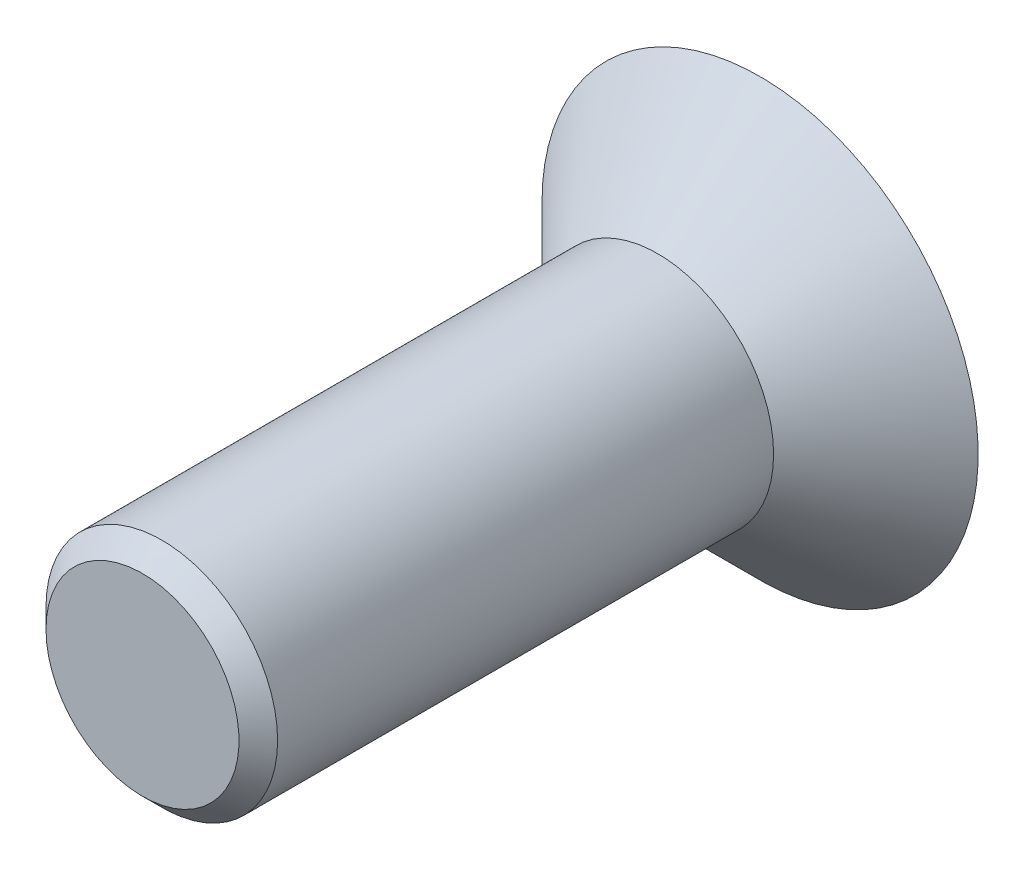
ISO-10303-21;
HEADER;
FILE_DESCRIPTION(('STEP AP214'),'2;1');
FILE_NAME('part.step','',(''),(''),'','','');
FILE_SCHEMA(('AUTOMOTIVE_DESIGN { 1 0 10303 214 1 1 1 1 }'));
ENDSEC;
DATA;
#1=APPLICATION_CONTEXT('core data for automotive mechanical design processes');
#2=APPLICATION_PROTOCOL_DEFINITION('international standard','automotive_design',2000,#1);
#3=PRODUCT_CONTEXT('',#1,'mechanical');
#4=PRODUCT('Part','Part','',(#3));
#5=PRODUCT_RELATED_PRODUCT_CATEGORY('part','',(#4));
#6=PRODUCT_DEFINITION_FORMATION('','',#4);
#7=PRODUCT_DEFINITION_CONTEXT('part definition',#1,'design');
#8=PRODUCT_DEFINITION('design','',#6,#7);
#9=PRODUCT_DEFINITION_SHAPE('','',#8);
#10=(LENGTH_UNIT() NAMED_UNIT(*) SI_UNIT(.MILLI.,.METRE.));
#11=(NAMED_UNIT(*) PLANE_ANGLE_UNIT() SI_UNIT($,.RADIAN.));
#12=(NAMED_UNIT(*) SI_UNIT($,.STERADIAN.) SOLID_ANGLE_UNIT());
#13=UNCERTAINTY_MEASURE_WITH_UNIT(LENGTH_MEASURE(1.E-05),#10,'distance_accuracy_value','');
#14=(GEOMETRIC_REPRESENTATION_CONTEXT(3) GLOBAL_UNCERTAINTY_ASSIGNED_CONTEXT((#13)) GLOBAL_UNIT_ASSIGNED_CONTEXT((#10,
#11,#12)) REPRESENTATION_CONTEXT('',''));
#15=CARTESIAN_POINT('',(0.,0.,0.));
#16=DIRECTION('',(0.,0.,1.));
#17=DIRECTION('',(1.,0.,0.));
#18=AXIS2_PLACEMENT_3D('',#15,#16,#17);
#19=CARTESIAN_POINT('',(0.,0.,2.65));
#20=DIRECTION('',(0.,0.,-1.));
#21=DIRECTION('',(-1.,0.,0.));
#22=AXIS2_PLACEMENT_3D('',#19,#20,#21);
#23=CONICAL_SURFACE('',#22,3.,0.785398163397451);
#24=CARTESIAN_POINT('',(0.,0.,0.));
#25=DIRECTION('',(0.,0.,-1.));
#26=DIRECTION('',(-1.,0.,0.));
#27=AXIS2_PLACEMENT_3D('',#24,#25,#26);
#28=CIRCLE('',#27,5.65000000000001);
#29=CARTESIAN_POINT('',(-5.65000000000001,0.,0.));
#30=VERTEX_POINT('',#29);
#31=EDGE_CURVE('E11',#30,#30,#28,.T.);
#32=ORIENTED_EDGE('',*,*,#31,.F.);
#33=EDGE_LOOP('',(#32));
#34=FACE_BOUND('',#33,.T.);
#35=CARTESIAN_POINT('',(0.,0.,2.65));
#36=DIRECTION('',(0.,0.,1.));
#37=DIRECTION('',(1.,0.,0.));
#38=AXIS2_PLACEMENT_3D('',#35,#36,#37);
#39=CIRCLE('',#38,3.);
#40=CARTESIAN_POINT('',(3.,0.,2.65));
#41=VERTEX_POINT('',#40);
#42=EDGE_CURVE('E146',#41,#41,#39,.T.);
#43=ORIENTED_EDGE('',*,*,#42,.F.);
#44=EDGE_LOOP('',(#43));
#45=FACE_BOUND('',#44,.T.);
#46=ADVANCED_FACE('F32',(#34,#45),#23,.T.);
#47=CARTESIAN_POINT('',(0.,0.,0.));
#48=DIRECTION('',(0.,0.,1.));
#49=DIRECTION('',(1.,0.,0.));
#50=AXIS2_PLACEMENT_3D('',#47,#48,#49);
#51=PLANE('',#50);
#52=DIRECTION('',(0.,-1.,0.));
#53=VECTOR('',#52,1.);
#54=CARTESIAN_POINT('',(2.,1.15470053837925,0.));
#55=LINE('',#54,#53);
#56=CARTESIAN_POINT('',(2.,1.15470053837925,0.));
#57=VERTEX_POINT('',#56);
#58=CARTESIAN_POINT('',(2.,-1.15470053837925,0.));
#59=VERTEX_POINT('',#58);
#60=EDGE_CURVE('E100',#57,#59,#55,.T.);
#61=ORIENTED_EDGE('',*,*,#60,.F.);
#62=DIRECTION('',(0.866025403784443,-0.499999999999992,0.));
#63=VECTOR('',#62,1.);
#64=CARTESIAN_POINT('',(2.,1.15470053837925,0.));
#65=LINE('',#64,#63);
#66=CARTESIAN_POINT('',(0.,2.30940107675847,0.));
#67=VERTEX_POINT('',#66);
#68=EDGE_CURVE('E47',#67,#57,#65,.T.);
#69=ORIENTED_EDGE('',*,*,#68,.F.);
#70=DIRECTION('',(0.866025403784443,0.499999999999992,0.));
#71=VECTOR('',#70,1.);
#72=CARTESIAN_POINT('',(-2.,1.15470053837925,0.));
#73=LINE('',#72,#71);
#74=CARTESIAN_POINT('',(-2.,1.15470053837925,0.));
#75=VERTEX_POINT('',#74);
#76=EDGE_CURVE('E115',#75,#67,#73,.T.);
#77=ORIENTED_EDGE('',*,*,#76,.F.);
#78=DIRECTION('',(0.,1.,0.));
#79=VECTOR('',#78,1.);
#80=CARTESIAN_POINT('',(-2.,1.15470053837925,0.));
#81=LINE('',#80,#79);
#82=CARTESIAN_POINT('',(-2.,-1.15470053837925,0.));
#83=VERTEX_POINT('',#82);
#84=EDGE_CURVE('E109',#83,#75,#81,.T.);
#85=ORIENTED_EDGE('',*,*,#84,.F.);
#86=DIRECTION('',(-0.866025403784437,0.500000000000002,0.));
#87=VECTOR('',#86,1.);
#88=CARTESIAN_POINT('',(-2.,-1.15470053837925,0.));
#89=LINE('',#88,#87);
#90=CARTESIAN_POINT('',(0.,-2.3094010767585,0.));
#91=VERTEX_POINT('',#90);
#92=EDGE_CURVE('E107',#91,#83,#89,.T.);
#93=ORIENTED_EDGE('',*,*,#92,.F.);
#94=DIRECTION('',(-0.866025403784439,-0.5,0.));
#95=VECTOR('',#94,1.);
#96=CARTESIAN_POINT('',(2.,-1.15470053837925,0.));
#97=LINE('',#96,#95);
#98=EDGE_CURVE('E89',#59,#91,#97,.T.);
#99=ORIENTED_EDGE('',*,*,#98,.F.);
#100=EDGE_LOOP('',(#61,#69,#77,#85,#93,#99));
#101=FACE_BOUND('',#100,.T.);
#102=ORIENTED_EDGE('',*,*,#31,.T.);
#103=EDGE_LOOP('',(#102));
#104=FACE_BOUND('',#103,.T.);
#105=ADVANCED_FACE('F34',(#101,#104),#51,.F.);
#106=CARTESIAN_POINT('',(2.,1.15470053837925,1.65625));
#107=DIRECTION('',(0.499999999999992,0.866025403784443,0.));
#108=DIRECTION('',(-0.866025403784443,0.499999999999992,0.));
#109=AXIS2_PLACEMENT_3D('',#106,#107,#108);
#110=PLANE('',#109);
#111=ORIENTED_EDGE('',*,*,#68,.T.);
#112=DIRECTION('',(0.,0.,-1.));
#113=VECTOR('',#112,1.);
#114=CARTESIAN_POINT('',(2.,1.15470053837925,1.65625));
#115=LINE('',#114,#113);
#116=CARTESIAN_POINT('',(2.,1.15470053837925,1.65625));
#117=VERTEX_POINT('',#116);
#118=EDGE_CURVE('E97',#117,#57,#115,.T.);
#119=ORIENTED_EDGE('',*,*,#118,.F.);
#120=DIRECTION('',(0.866025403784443,-0.499999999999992,0.));
#121=VECTOR('',#120,1.);
#122=CARTESIAN_POINT('',(2.,1.15470053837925,1.65625));
#123=LINE('',#122,#121);
#124=CARTESIAN_POINT('',(0.,2.30940107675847,1.65625));
#125=VERTEX_POINT('',#124);
#126=EDGE_CURVE('E117',#125,#117,#123,.T.);
#127=ORIENTED_EDGE('',*,*,#126,.F.);
#128=DIRECTION('',(0.,0.,-1.));
#129=VECTOR('',#128,1.);
#130=CARTESIAN_POINT('',(0.,2.30940107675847,1.65625));
#131=LINE('',#130,#129);
#132=EDGE_CURVE('E40',#125,#67,#131,.T.);
#133=ORIENTED_EDGE('',*,*,#132,.T.);
#134=EDGE_LOOP('',(#111,#119,#127,#133));
#135=FACE_BOUND('',#134,.T.);
#136=ADVANCED_FACE('F143',(#135),#110,.F.);
#137=CARTESIAN_POINT('',(-2.,1.15470053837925,1.65625));
#138=DIRECTION('',(-0.499999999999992,0.866025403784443,0.));
#139=DIRECTION('',(-0.866025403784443,-0.499999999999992,0.));
#140=AXIS2_PLACEMENT_3D('',#137,#138,#139);
#141=PLANE('',#140);
#142=ORIENTED_EDGE('',*,*,#76,.T.);
#143=ORIENTED_EDGE('',*,*,#132,.F.);
#144=DIRECTION('',(0.866025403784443,0.499999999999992,0.));
#145=VECTOR('',#144,1.);
#146=CARTESIAN_POINT('',(-2.,1.15470053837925,1.65625));
#147=LINE('',#146,#145);
#148=CARTESIAN_POINT('',(-2.,1.15470053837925,1.65625));
#149=VERTEX_POINT('',#148);
#150=EDGE_CURVE('E129',#149,#125,#147,.T.);
#151=ORIENTED_EDGE('',*,*,#150,.F.);
#152=DIRECTION('',(0.,0.,-1.));
#153=VECTOR('',#152,1.);
#154=CARTESIAN_POINT('',(-2.,1.15470053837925,1.65625));
#155=LINE('',#154,#153);
#156=EDGE_CURVE('E133',#149,#75,#155,.T.);
#157=ORIENTED_EDGE('',*,*,#156,.T.);
#158=EDGE_LOOP('',(#142,#143,#151,#157));
#159=FACE_BOUND('',#158,.T.);
#160=ADVANCED_FACE('F145',(#159),#141,.F.);
#161=CARTESIAN_POINT('',(-2.,1.15470053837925,1.65625));
#162=DIRECTION('',(-1.,0.,0.));
#163=DIRECTION('',(0.,0.,1.));
#164=AXIS2_PLACEMENT_3D('',#161,#162,#163);
#165=PLANE('',#164);
#166=ORIENTED_EDGE('',*,*,#84,.T.);
#167=ORIENTED_EDGE('',*,*,#156,.F.);
#168=DIRECTION('',(0.,1.,0.));
#169=VECTOR('',#168,1.);
#170=CARTESIAN_POINT('',(-2.,1.15470053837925,1.65625));
#171=LINE('',#170,#169);
#172=CARTESIAN_POINT('',(-2.,-1.15470053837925,1.65625));
#173=VERTEX_POINT('',#172);
#174=EDGE_CURVE('E126',#173,#149,#171,.T.);
#175=ORIENTED_EDGE('',*,*,#174,.F.);
#176=DIRECTION('',(0.,0.,-1.));
#177=VECTOR('',#176,1.);
#178=CARTESIAN_POINT('',(-2.,-1.15470053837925,1.65625));
#179=LINE('',#178,#177);
#180=EDGE_CURVE('E135',#173,#83,#179,.T.);
#181=ORIENTED_EDGE('',*,*,#180,.T.);
#182=EDGE_LOOP('',(#166,#167,#175,#181));
#183=FACE_BOUND('',#182,.T.);
#184=ADVANCED_FACE('F188',(#183),#165,.F.);
#185=CARTESIAN_POINT('',(-2.,-1.15470053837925,1.65625));
#186=DIRECTION('',(-0.500000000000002,-0.866025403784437,0.));
#187=DIRECTION('',(0.866025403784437,-0.500000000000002,0.));
#188=AXIS2_PLACEMENT_3D('',#185,#186,#187);
#189=PLANE('',#188);
#190=ORIENTED_EDGE('',*,*,#92,.T.);
#191=ORIENTED_EDGE('',*,*,#180,.F.);
#192=DIRECTION('',(-0.866025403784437,0.500000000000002,0.));
#193=VECTOR('',#192,1.);
#194=CARTESIAN_POINT('',(-2.,-1.15470053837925,1.65625));
#195=LINE('',#194,#193);
#196=CARTESIAN_POINT('',(0.,-2.3094010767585,1.65625));
#197=VERTEX_POINT('',#196);
#198=EDGE_CURVE('E123',#197,#173,#195,.T.);
#199=ORIENTED_EDGE('',*,*,#198,.F.);
#200=DIRECTION('',(0.,0.,-1.));
#201=VECTOR('',#200,1.);
#202=CARTESIAN_POINT('',(0.,-2.3094010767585,1.65625));
#203=LINE('',#202,#201);
#204=EDGE_CURVE('E96',#197,#91,#203,.T.);
#205=ORIENTED_EDGE('',*,*,#204,.T.);
#206=EDGE_LOOP('',(#190,#191,#199,#205));
#207=FACE_BOUND('',#206,.T.);
#208=ADVANCED_FACE('F139',(#207),#189,.F.);
#209=CARTESIAN_POINT('',(2.,-1.15470053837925,1.65625));
#210=DIRECTION('',(0.5,-0.866025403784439,0.));
#211=DIRECTION('',(0.866025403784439,0.5,0.));
#212=AXIS2_PLACEMENT_3D('',#209,#210,#211);
#213=PLANE('',#212);
#214=ORIENTED_EDGE('',*,*,#98,.T.);
#215=ORIENTED_EDGE('',*,*,#204,.F.);
#216=DIRECTION('',(-0.866025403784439,-0.5,0.));
#217=VECTOR('',#216,1.);
#218=CARTESIAN_POINT('',(2.,-1.15470053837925,1.65625));
#219=LINE('',#218,#217);
#220=CARTESIAN_POINT('',(2.,-1.15470053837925,1.65625));
#221=VERTEX_POINT('',#220);
#222=EDGE_CURVE('E92',#221,#197,#219,.T.);
#223=ORIENTED_EDGE('',*,*,#222,.F.);
#224=DIRECTION('',(0.,0.,-1.));
#225=VECTOR('',#224,1.);
#226=CARTESIAN_POINT('',(2.,-1.15470053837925,1.65625));
#227=LINE('',#226,#225);
#228=EDGE_CURVE('E85',#221,#59,#227,.T.);
#229=ORIENTED_EDGE('',*,*,#228,.T.);
#230=EDGE_LOOP('',(#214,#215,#223,#229));
#231=FACE_BOUND('',#230,.T.);
#232=ADVANCED_FACE('F87',(#231),#213,.F.);
#233=CARTESIAN_POINT('',(2.,1.15470053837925,1.65625));
#234=DIRECTION('',(1.,0.,0.));
#235=DIRECTION('',(0.,0.,-1.));
#236=AXIS2_PLACEMENT_3D('',#233,#234,#235);
#237=PLANE('',#236);
#238=ORIENTED_EDGE('',*,*,#60,.T.);
#239=ORIENTED_EDGE('',*,*,#228,.F.);
#240=DIRECTION('',(0.,-1.,0.));
#241=VECTOR('',#240,1.);
#242=CARTESIAN_POINT('',(2.,1.15470053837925,1.65625));
#243=LINE('',#242,#241);
#244=EDGE_CURVE('E120',#117,#221,#243,.T.);
#245=ORIENTED_EDGE('',*,*,#244,.F.);
#246=ORIENTED_EDGE('',*,*,#118,.T.);
#247=EDGE_LOOP('',(#238,#239,#245,#246));
#248=FACE_BOUND('',#247,.T.);
#249=ADVANCED_FACE('F101',(#248),#237,.F.);
#250=CARTESIAN_POINT('',(-2.,3.4641016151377,1.65625));
#251=DIRECTION('',(0.,0.,1.));
#252=DIRECTION('',(1.,0.,0.));
#253=AXIS2_PLACEMENT_3D('',#250,#251,#252);
#254=PLANE('',#253);
#255=ORIENTED_EDGE('',*,*,#126,.T.);
#256=ORIENTED_EDGE('',*,*,#244,.T.);
#257=ORIENTED_EDGE('',*,*,#222,.T.);
#258=ORIENTED_EDGE('',*,*,#198,.T.);
#259=ORIENTED_EDGE('',*,*,#174,.T.);
#260=ORIENTED_EDGE('',*,*,#150,.T.);
#261=EDGE_LOOP('',(#255,#256,#257,#258,#259,#260));
#262=FACE_BOUND('',#261,.T.);
#263=ADVANCED_FACE('F142',(#262),#254,.F.);
#264=CARTESIAN_POINT('',(0.,0.,16.));
#265=DIRECTION('',(0.,0.,-1.));
#266=DIRECTION('',(-1.,0.,0.));
#267=AXIS2_PLACEMENT_3D('',#264,#265,#266);
#268=CYLINDRICAL_SURFACE('',#267,3.);
#269=CARTESIAN_POINT('',(0.,0.,15.5));
#270=DIRECTION('',(0.,0.,-1.));
#271=DIRECTION('',(-1.,0.,0.));
#272=AXIS2_PLACEMENT_3D('',#269,#270,#271);
#273=CIRCLE('',#272,3.);
#274=CARTESIAN_POINT('',(-3.,0.,15.5));
#275=VERTEX_POINT('',#274);
#276=EDGE_CURVE('E153',#275,#275,#273,.T.);
#277=ORIENTED_EDGE('',*,*,#276,.T.);
#278=EDGE_LOOP('',(#277));
#279=FACE_BOUND('',#278,.T.);
#280=ORIENTED_EDGE('',*,*,#42,.T.);
#281=EDGE_LOOP('',(#280));
#282=FACE_BOUND('',#281,.T.);
#283=ADVANCED_FACE('F157',(#279,#282),#268,.T.);
#284=CARTESIAN_POINT('',(0.,0.,16.));
#285=DIRECTION('',(0.,0.,-1.));
#286=DIRECTION('',(-1.,0.,0.));
#287=AXIS2_PLACEMENT_3D('',#284,#285,#286);
#288=CONICAL_SURFACE('',#287,2.5,0.785398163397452);
#289=ORIENTED_EDGE('',*,*,#276,.F.);
#290=EDGE_LOOP('',(#289));
#291=FACE_BOUND('',#290,.T.);
#292=CARTESIAN_POINT('',(0.,0.,16.));
#293=DIRECTION('',(0.,0.,-1.));
#294=DIRECTION('',(-1.,0.,0.));
#295=AXIS2_PLACEMENT_3D('',#292,#293,#294);
#296=CIRCLE('',#295,2.5);
#297=CARTESIAN_POINT('',(-2.5,0.,16.));
#298=VERTEX_POINT('',#297);
#299=EDGE_CURVE('E148',#298,#298,#296,.T.);
#300=ORIENTED_EDGE('',*,*,#299,.T.);
#301=EDGE_LOOP('',(#300));
#302=FACE_BOUND('',#301,.T.);
#303=ADVANCED_FACE('F160',(#291,#302),#288,.T.);
#304=CARTESIAN_POINT('',(0.,0.,16.));
#305=DIRECTION('',(0.,0.,1.));
#306=DIRECTION('',(1.,0.,0.));
#307=AXIS2_PLACEMENT_3D('',#304,#305,#306);
#308=PLANE('',#307);
#309=ORIENTED_EDGE('',*,*,#299,.F.);
#310=EDGE_LOOP('',(#309));
#311=FACE_BOUND('',#310,.T.);
#312=ADVANCED_FACE('F163',(#311),#308,.T.);
#313=CLOSED_SHELL('',(#46,#105,#136,#160,#184,#208,#232,#249,#263,#283,#303,#312));
#314=MANIFOLD_SOLID_BREP('B2',#313);
#315=ADVANCED_BREP_SHAPE_REPRESENTATION('',(#18,#314),#14);
#316=SHAPE_DEFINITION_REPRESENTATION(#9,#315);
ENDSEC;
END-ISO-10303-21;
